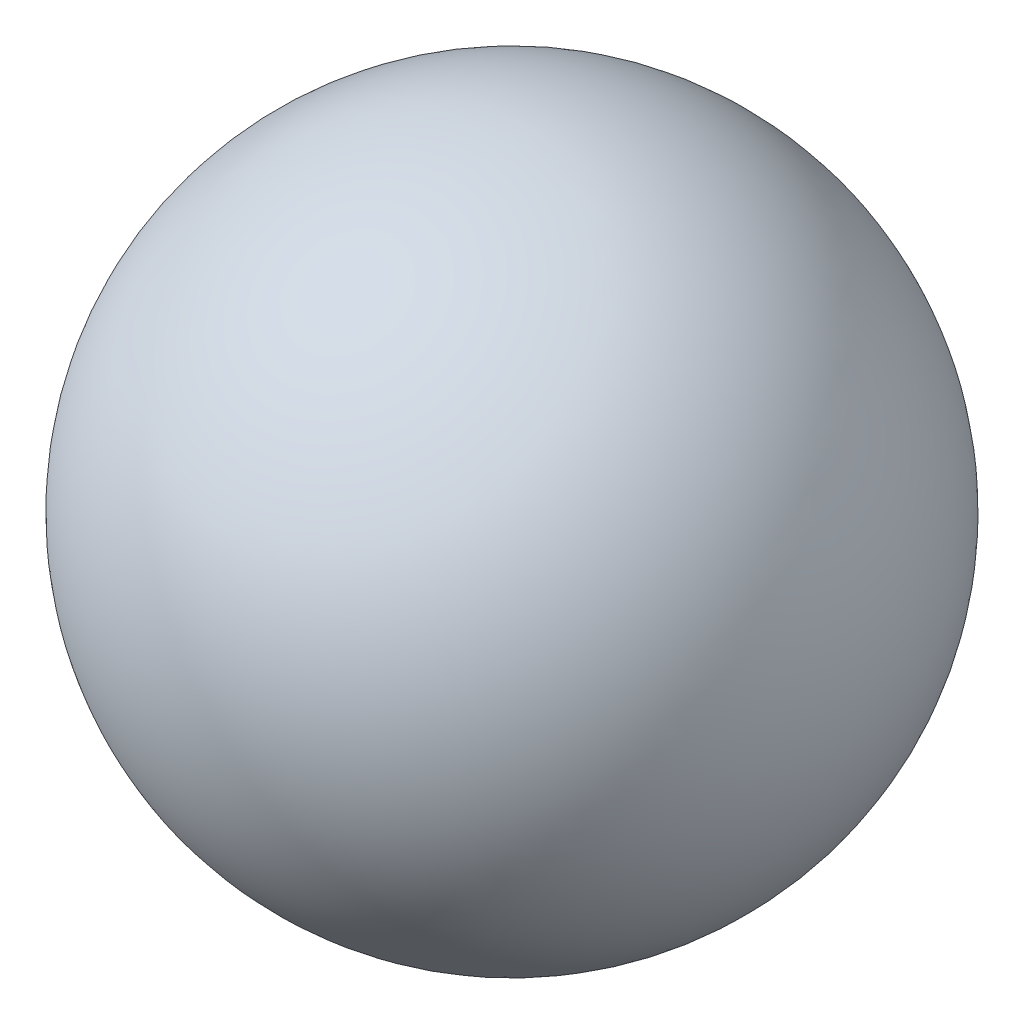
from build123d import *


with BuildPart() as part:
    # Sketch1 → Revolve1 (revolve)
    with BuildSketch(Plane(origin=(0, 0, 0), x_dir=(0, 0, -1), z_dir=(1, 0, 0))):
        with BuildLine():
            Line((-2.5, 0), (2.5, 0))
            ThreePointArc((2.5, 0), (0, 2.5), (-2.5, 0))
        make_face()
    revolve(axis=Axis((0, 0, 2.5), (0, 0, -1)))


solid = part.part
